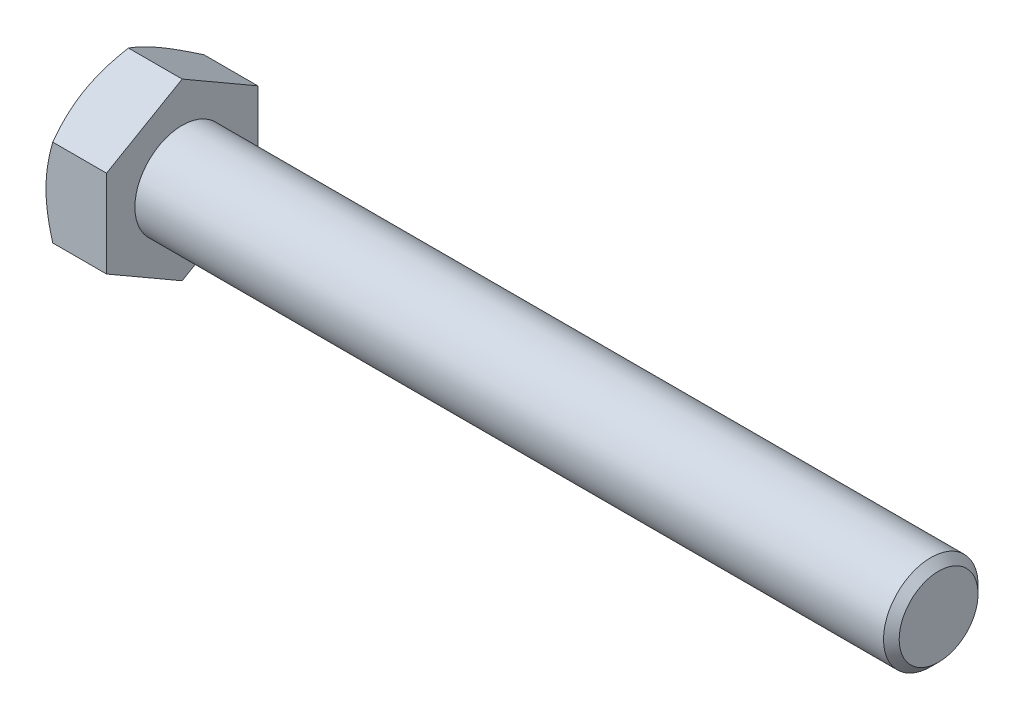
ISO-10303-21;
HEADER;
FILE_DESCRIPTION(('STEP AP214'),'2;1');
FILE_NAME('part.step','',(''),(''),'','','');
FILE_SCHEMA(('AUTOMOTIVE_DESIGN { 1 0 10303 214 1 1 1 1 }'));
ENDSEC;
DATA;
#1=APPLICATION_CONTEXT('core data for automotive mechanical design processes');
#2=APPLICATION_PROTOCOL_DEFINITION('international standard','automotive_design',2000,#1);
#3=PRODUCT_CONTEXT('',#1,'mechanical');
#4=PRODUCT('Part','Part','',(#3));
#5=PRODUCT_RELATED_PRODUCT_CATEGORY('part','',(#4));
#6=PRODUCT_DEFINITION_FORMATION('','',#4);
#7=PRODUCT_DEFINITION_CONTEXT('part definition',#1,'design');
#8=PRODUCT_DEFINITION('design','',#6,#7);
#9=PRODUCT_DEFINITION_SHAPE('','',#8);
#10=(LENGTH_UNIT() NAMED_UNIT(*) SI_UNIT(.MILLI.,.METRE.));
#11=(NAMED_UNIT(*) PLANE_ANGLE_UNIT() SI_UNIT($,.RADIAN.));
#12=(NAMED_UNIT(*) SI_UNIT($,.STERADIAN.) SOLID_ANGLE_UNIT());
#13=UNCERTAINTY_MEASURE_WITH_UNIT(LENGTH_MEASURE(1.E-05),#10,'distance_accuracy_value','');
#14=(GEOMETRIC_REPRESENTATION_CONTEXT(3) GLOBAL_UNCERTAINTY_ASSIGNED_CONTEXT((#13)) GLOBAL_UNIT_ASSIGNED_CONTEXT((#10,
#11,#12)) REPRESENTATION_CONTEXT('',''));
#15=CARTESIAN_POINT('',(0.,0.,0.));
#16=DIRECTION('',(0.,0.,1.));
#17=DIRECTION('',(1.,0.,0.));
#18=AXIS2_PLACEMENT_3D('',#15,#16,#17);
#19=CARTESIAN_POINT('',(6.4,9.23760430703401,0.));
#20=DIRECTION('',(1.,0.,0.));
#21=DIRECTION('',(0.,0.,-1.));
#22=AXIS2_PLACEMENT_3D('',#19,#20,#21);
#23=PLANE('',#22);
#24=DIRECTION('',(0.,0.5,0.866025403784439));
#25=VECTOR('',#24,1.);
#26=CARTESIAN_POINT('',(6.4,4.618802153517,-7.99999999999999));
#27=LINE('',#26,#25);
#28=CARTESIAN_POINT('',(6.4,4.618802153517,-7.99999999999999));
#29=VERTEX_POINT('',#28);
#30=CARTESIAN_POINT('',(6.4,9.23760430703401,0.));
#31=VERTEX_POINT('',#30);
#32=EDGE_CURVE('E160',#29,#31,#27,.T.);
#33=ORIENTED_EDGE('',*,*,#32,.T.);
#34=DIRECTION('',(0.,-0.5,0.866025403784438));
#35=VECTOR('',#34,1.);
#36=CARTESIAN_POINT('',(6.4,9.23760430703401,0.));
#37=LINE('',#36,#35);
#38=CARTESIAN_POINT('',(6.4,4.618802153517,8.00000000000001));
#39=VERTEX_POINT('',#38);
#40=EDGE_CURVE('E151',#31,#39,#37,.T.);
#41=ORIENTED_EDGE('',*,*,#40,.T.);
#42=DIRECTION('',(0.,-1.,0.));
#43=VECTOR('',#42,1.);
#44=CARTESIAN_POINT('',(6.4,4.618802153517,8.00000000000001));
#45=LINE('',#44,#43);
#46=CARTESIAN_POINT('',(6.4,-4.61880215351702,8.00000000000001));
#47=VERTEX_POINT('',#46);
#48=EDGE_CURVE('E134',#39,#47,#45,.T.);
#49=ORIENTED_EDGE('',*,*,#48,.T.);
#50=DIRECTION('',(0.,-0.500000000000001,-0.866025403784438));
#51=VECTOR('',#50,1.);
#52=CARTESIAN_POINT('',(6.4,-4.61880215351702,8.00000000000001));
#53=LINE('',#52,#51);
#54=CARTESIAN_POINT('',(6.4,-9.23760430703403,0.));
#55=VERTEX_POINT('',#54);
#56=EDGE_CURVE('E154',#47,#55,#53,.T.);
#57=ORIENTED_EDGE('',*,*,#56,.T.);
#58=DIRECTION('',(0.,0.5,-0.866025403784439));
#59=VECTOR('',#58,1.);
#60=CARTESIAN_POINT('',(6.4,-9.23760430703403,0.));
#61=LINE('',#60,#59);
#62=CARTESIAN_POINT('',(6.4,-4.61880215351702,-7.99999999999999));
#63=VERTEX_POINT('',#62);
#64=EDGE_CURVE('E146',#55,#63,#61,.T.);
#65=ORIENTED_EDGE('',*,*,#64,.T.);
#66=DIRECTION('',(0.,1.,0.));
#67=VECTOR('',#66,1.);
#68=CARTESIAN_POINT('',(6.4,-4.61880215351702,-7.99999999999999));
#69=LINE('',#68,#67);
#70=EDGE_CURVE('E147',#63,#29,#69,.T.);
#71=ORIENTED_EDGE('',*,*,#70,.T.);
#72=EDGE_LOOP('',(#33,#41,#49,#57,#65,#71));
#73=FACE_BOUND('',#72,.T.);
#74=CARTESIAN_POINT('',(6.4,0.,0.));
#75=DIRECTION('',(1.,0.,0.));
#76=DIRECTION('',(0.,0.,-1.));
#77=AXIS2_PLACEMENT_3D('',#74,#75,#76);
#78=CIRCLE('',#77,5.00000000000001);
#79=CARTESIAN_POINT('',(6.4,0.,-5.00000000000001));
#80=VERTEX_POINT('',#79);
#81=EDGE_CURVE('E249',#80,#80,#78,.F.);
#82=ORIENTED_EDGE('',*,*,#81,.T.);
#83=EDGE_LOOP('',(#82));
#84=FACE_BOUND('',#83,.T.);
#85=ADVANCED_FACE('F39',(#73,#84),#23,.T.);
#86=CARTESIAN_POINT('',(6.4,4.618802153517,-7.99999999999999));
#87=DIRECTION('',(0.,-0.866025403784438,0.5));
#88=DIRECTION('',(0.,-0.5,-0.866025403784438));
#89=AXIS2_PLACEMENT_3D('',#86,#87,#88);
#90=PLANE('',#89);
#91=CARTESIAN_POINT('',(0.71459784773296,9.23771977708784,0.000200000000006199));
#92=CARTESIAN_POINT('',(0.655990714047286,9.13619343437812,-0.17564878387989));
#93=CARTESIAN_POINT('',(0.600043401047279,9.03428856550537,-0.352153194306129));
#94=CARTESIAN_POINT('',(0.494201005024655,8.82965122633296,-0.706595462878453));
#95=CARTESIAN_POINT('',(0.444308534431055,8.72691841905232,-0.884533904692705));
#96=CARTESIAN_POINT('',(0.304692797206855,8.41707512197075,-1.42119823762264));
#97=CARTESIAN_POINT('',(0.225281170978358,8.20874154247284,-1.78204258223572));
#98=CARTESIAN_POINT('',(0.132161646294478,7.89697436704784,-2.32203917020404));
#99=CARTESIAN_POINT('',(0.105634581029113,7.79447216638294,-2.49957818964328));
#100=CARTESIAN_POINT('',(0.0611531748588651,7.58900421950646,-2.85545911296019));
#101=CARTESIAN_POINT('',(0.0431980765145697,7.48603851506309,-3.03380094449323));
#102=CARTESIAN_POINT('',(0.0163156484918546,7.27992981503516,-3.39079168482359));
#103=CARTESIAN_POINT('',(0.00737807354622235,7.17678715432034,-3.56944001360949));
#104=CARTESIAN_POINT('',(-0.00127769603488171,6.97040655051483,-3.92690170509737));
#105=CARTESIAN_POINT('',(-0.000996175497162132,6.86716861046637,-4.10571506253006));
#106=CARTESIAN_POINT('',(0.00814502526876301,6.67416139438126,-4.4400133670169));
#107=CARTESIAN_POINT('',(0.0158896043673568,6.58437849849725,-4.59552190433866));
#108=CARTESIAN_POINT('',(0.0382011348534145,6.40502298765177,-4.9061747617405));
#109=CARTESIAN_POINT('',(0.0527685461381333,6.31545038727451,-5.06131905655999));
#110=CARTESIAN_POINT('',(0.106360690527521,6.04707935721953,-5.52615131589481));
#111=CARTESIAN_POINT('',(0.155268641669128,5.86875596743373,-5.83501648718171));
#112=CARTESIAN_POINT('',(0.277539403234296,5.51021755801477,-6.45602322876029));
#113=CARTESIAN_POINT('',(0.35142052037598,5.3300482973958,-6.76808554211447));
#114=CARTESIAN_POINT('',(0.519100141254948,4.97239658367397,-7.38755648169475));
#115=CARTESIAN_POINT('',(0.61285926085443,4.79490955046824,-7.69497304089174));
#116=CARTESIAN_POINT('',(0.71459784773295,4.61868668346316,-8.00019999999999));
#117=B_SPLINE_CURVE_WITH_KNOTS('',3,(#91,#92,#93,#94,#95,#96,#97,#98,#99,#100,#101,#102,#103,
#104,#105,#106,#107,#108,#109,#110,#111,#112,#113,#114,#115,#116),.UNSPECIFIED.,.F.,.F.,(4,2,2,
2,2,2,2,2,2,2,2,2,4),(0.,0.633973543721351,1.26821965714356,2.53934712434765,3.15934343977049,
3.77928496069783,4.39852133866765,5.01773858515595,5.55680239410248,6.09590254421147,
7.17487077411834,8.27776850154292,9.37850115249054),.UNSPECIFIED.);
#118=CARTESIAN_POINT('',(0.714531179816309,9.23760430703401,0.));
#119=VERTEX_POINT('',#118);
#120=CARTESIAN_POINT('',(0.,6.92820323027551,-4.00000000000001));
#121=VERTEX_POINT('',#120);
#122=EDGE_CURVE('E57',#119,#121,#117,.T.);
#123=ORIENTED_EDGE('',*,*,#122,.F.);
#124=DIRECTION('',(-1.,0.,0.));
#125=VECTOR('',#124,1.);
#126=CARTESIAN_POINT('',(6.4,9.23760430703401,0.));
#127=LINE('',#126,#125);
#128=EDGE_CURVE('E132',#31,#119,#127,.T.);
#129=ORIENTED_EDGE('',*,*,#128,.F.);
#130=ORIENTED_EDGE('',*,*,#32,.F.);
#131=DIRECTION('',(-1.,0.,0.));
#132=VECTOR('',#131,1.);
#133=CARTESIAN_POINT('',(6.4,4.618802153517,-7.99999999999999));
#134=LINE('',#133,#132);
#135=CARTESIAN_POINT('',(0.714531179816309,4.61880215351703,-7.99999999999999));
#136=VERTEX_POINT('',#135);
#137=EDGE_CURVE('E143',#29,#136,#134,.T.);
#138=ORIENTED_EDGE('',*,*,#137,.T.);
#139=EDGE_CURVE('E202',#121,#136,#117,.T.);
#140=ORIENTED_EDGE('',*,*,#139,.F.);
#141=EDGE_LOOP('',(#123,#129,#130,#138,#140));
#142=FACE_BOUND('',#141,.T.);
#143=ADVANCED_FACE('F41',(#142),#90,.F.);
#144=CARTESIAN_POINT('',(6.4,9.23760430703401,0.));
#145=DIRECTION('',(0.,-0.866025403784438,-0.5));
#146=DIRECTION('',(0.,0.5,-0.866025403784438));
#147=AXIS2_PLACEMENT_3D('',#144,#145,#146);
#148=PLANE('',#147);
#149=CARTESIAN_POINT('',(0.71459784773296,4.61868668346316,8.00020000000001));
#150=CARTESIAN_POINT('',(0.655990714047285,4.72021302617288,7.82435121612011));
#151=CARTESIAN_POINT('',(0.600043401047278,4.82211789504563,7.64784680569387));
#152=CARTESIAN_POINT('',(0.494201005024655,5.02675523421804,7.29340453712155));
#153=CARTESIAN_POINT('',(0.444308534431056,5.12948804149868,7.1154660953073));
#154=CARTESIAN_POINT('',(0.304692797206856,5.43933133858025,6.57880176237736));
#155=CARTESIAN_POINT('',(0.22528117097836,5.64766491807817,6.21795741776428));
#156=CARTESIAN_POINT('',(0.132161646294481,5.95943209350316,5.67796082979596));
#157=CARTESIAN_POINT('',(0.105634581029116,6.06193429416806,5.50042181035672));
#158=CARTESIAN_POINT('',(0.0611531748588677,6.26740224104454,5.14454088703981));
#159=CARTESIAN_POINT('',(0.0431980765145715,6.37036794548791,4.96619905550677));
#160=CARTESIAN_POINT('',(0.0163156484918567,6.57647664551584,4.60920831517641));
#161=CARTESIAN_POINT('',(0.00737807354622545,6.67961930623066,4.43055998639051));
#162=CARTESIAN_POINT('',(-0.00127769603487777,6.88599991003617,4.07309829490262));
#163=CARTESIAN_POINT('',(-0.000996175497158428,6.98923785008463,3.89428493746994));
#164=CARTESIAN_POINT('',(0.00814502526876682,7.18224506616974,3.5599866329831));
#165=CARTESIAN_POINT('',(0.0158896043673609,7.27202796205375,3.40447809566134));
#166=CARTESIAN_POINT('',(0.0382011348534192,7.45138347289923,3.0938252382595));
#167=CARTESIAN_POINT('',(0.0527685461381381,7.54095607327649,2.93868094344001));
#168=CARTESIAN_POINT('',(0.106360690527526,7.80932710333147,2.47384868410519));
#169=CARTESIAN_POINT('',(0.155268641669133,7.98765049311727,2.16498351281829));
#170=CARTESIAN_POINT('',(0.277539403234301,8.34618890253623,1.54397677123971));
#171=CARTESIAN_POINT('',(0.351420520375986,8.52635816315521,1.23191445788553));
#172=CARTESIAN_POINT('',(0.519100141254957,8.88400987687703,0.612443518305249));
#173=CARTESIAN_POINT('',(0.61285926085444,9.06149691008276,0.305026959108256));
#174=CARTESIAN_POINT('',(0.714597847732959,9.23771977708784,-0.000199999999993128));
#175=B_SPLINE_CURVE_WITH_KNOTS('',3,(#149,#150,#151,#152,#153,#154,#155,#156,#157,#158,#159,
#160,#161,#162,#163,#164,#165,#166,#167,#168,#169,#170,#171,#172,#173,#174),.UNSPECIFIED.,.F.,
.F.,(4,2,2,2,2,2,2,2,2,2,2,2,4),(0.,0.63397354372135,1.26821965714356,2.53934712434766,
3.15934343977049,3.77928496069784,4.39852133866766,5.01773858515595,5.55680239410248,
6.09590254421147,7.17487077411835,8.27776850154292,9.37850115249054),.UNSPECIFIED.);
#176=CARTESIAN_POINT('',(0.714531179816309,4.61880215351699,8.00000000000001));
#177=VERTEX_POINT('',#176);
#178=CARTESIAN_POINT('',(0.,6.92820323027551,4.00000000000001));
#179=VERTEX_POINT('',#178);
#180=EDGE_CURVE('E62',#177,#179,#175,.T.);
#181=ORIENTED_EDGE('',*,*,#180,.F.);
#182=DIRECTION('',(-1.,0.,0.));
#183=VECTOR('',#182,1.);
#184=CARTESIAN_POINT('',(6.4,4.618802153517,8.00000000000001));
#185=LINE('',#184,#183);
#186=EDGE_CURVE('E123',#39,#177,#185,.T.);
#187=ORIENTED_EDGE('',*,*,#186,.F.);
#188=ORIENTED_EDGE('',*,*,#40,.F.);
#189=ORIENTED_EDGE('',*,*,#128,.T.);
#190=EDGE_CURVE('E127',#179,#119,#175,.T.);
#191=ORIENTED_EDGE('',*,*,#190,.F.);
#192=EDGE_LOOP('',(#181,#187,#188,#189,#191));
#193=FACE_BOUND('',#192,.T.);
#194=ADVANCED_FACE('F121',(#193),#148,.F.);
#195=CARTESIAN_POINT('',(6.4,4.618802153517,8.00000000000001));
#196=DIRECTION('',(0.,0.,-1.));
#197=DIRECTION('',(-1.,0.,0.));
#198=AXIS2_PLACEMENT_3D('',#195,#196,#197);
#199=PLANE('',#198);
#200=CARTESIAN_POINT('',(3.82821364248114,-12.2497439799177,8.00000000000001));
#201=CARTESIAN_POINT('',(3.65847254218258,-11.8984987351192,8.00000000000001));
#202=CARTESIAN_POINT('',(3.49041880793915,-11.5464230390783,8.00000000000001));
#203=CARTESIAN_POINT('',(3.15865029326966,-10.8401616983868,8.00000000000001));
#204=CARTESIAN_POINT('',(2.9949362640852,-10.4859757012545,8.00000000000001));
#205=CARTESIAN_POINT('',(2.67194892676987,-9.77313142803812,8.00000000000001));
#206=CARTESIAN_POINT('',(2.51270639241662,-9.41445915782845,8.00000000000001));
#207=CARTESIAN_POINT('',(2.20106116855,-8.69416671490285,8.00000000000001));
#208=CARTESIAN_POINT('',(2.04865812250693,-8.33254669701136,8.00000000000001));
#209=CARTESIAN_POINT('',(1.75070130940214,-7.60129405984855,8.00000000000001));
#210=CARTESIAN_POINT('',(1.60525460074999,-7.23161757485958,8.00000000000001));
#211=CARTESIAN_POINT('',(1.3257524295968,-6.48790521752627,8.00000000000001));
#212=CARTESIAN_POINT('',(1.1916982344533,-6.11386886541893,8.00000000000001));
#213=CARTESIAN_POINT('',(0.93858361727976,-5.36160531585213,8.00000000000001));
#214=CARTESIAN_POINT('',(0.81949131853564,-4.98338896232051,8.00000000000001));
#215=CARTESIAN_POINT('',(0.600166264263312,-4.22159300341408,8.00000000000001));
#216=CARTESIAN_POINT('',(0.499927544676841,-3.83801513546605,8.00000000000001));
#217=CARTESIAN_POINT('',(0.323183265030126,-3.06517005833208,8.00000000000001));
#218=CARTESIAN_POINT('',(0.246684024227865,-2.67590136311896,8.00000000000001));
#219=CARTESIAN_POINT('',(0.153570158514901,-2.08857290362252,8.00000000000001));
#220=CARTESIAN_POINT('',(0.126136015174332,-1.89220175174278,8.00000000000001));
#221=CARTESIAN_POINT('',(0.0790191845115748,-1.49853877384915,8.00000000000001));
#222=CARTESIAN_POINT('',(0.0593357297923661,-1.3012470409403,8.00000000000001));
#223=CARTESIAN_POINT('',(0.0282499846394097,-0.907261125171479,8.00000000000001));
#224=CARTESIAN_POINT('',(0.0167962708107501,-0.71057101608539,8.00000000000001));
#225=CARTESIAN_POINT('',(0.0022305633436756,-0.316882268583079,8.00000000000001));
#226=CARTESIAN_POINT('',(-0.00088153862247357,-0.119883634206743,8.00000000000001));
#227=CARTESIAN_POINT('',(0.00131013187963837,0.274012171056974,8.00000000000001));
#228=CARTESIAN_POINT('',(0.00661154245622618,0.47090935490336,8.00000000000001));
#229=CARTESIAN_POINT('',(0.0254984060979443,0.864308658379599,8.00000000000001));
#230=CARTESIAN_POINT('',(0.0390842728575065,1.06081075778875,8.00000000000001));
#231=CARTESIAN_POINT('',(0.0817685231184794,1.53707134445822,8.00000000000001));
#232=CARTESIAN_POINT('',(0.11501771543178,1.81646391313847,8.00000000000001));
#233=CARTESIAN_POINT('',(0.196418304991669,2.37310809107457,8.00000000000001));
#234=CARTESIAN_POINT('',(0.244573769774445,2.65035909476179,8.00000000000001));
#235=CARTESIAN_POINT('',(0.354078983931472,3.20249141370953,8.00000000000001));
#236=CARTESIAN_POINT('',(0.415441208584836,3.47737023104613,8.00000000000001));
#237=CARTESIAN_POINT('',(0.549487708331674,4.02429975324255,8.00000000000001));
#238=CARTESIAN_POINT('',(0.622170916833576,4.29635072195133,8.00000000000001));
#239=CARTESIAN_POINT('',(0.779020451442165,4.84432510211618,8.00000000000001));
#240=CARTESIAN_POINT('',(0.863424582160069,5.12017997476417,8.00000000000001));
#241=CARTESIAN_POINT('',(1.04057245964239,5.66897392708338,8.00000000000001));
#242=CARTESIAN_POINT('',(1.13331045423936,5.94191487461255,8.00000000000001));
#243=CARTESIAN_POINT('',(1.32521046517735,6.48378576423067,8.00000000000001));
#244=CARTESIAN_POINT('',(1.42433338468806,6.75272963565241,8.00000000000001));
#245=CARTESIAN_POINT('',(1.62839717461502,7.28853074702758,8.00000000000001));
#246=CARTESIAN_POINT('',(1.73334039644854,7.5553870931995,8.00000000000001));
#247=CARTESIAN_POINT('',(1.84061801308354,7.82127397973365,8.00000000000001));
#248=B_SPLINE_CURVE_WITH_KNOTS('',3,(#200,#201,#202,#203,#204,#205,#206,#207,#208,#209,#210,
#211,#212,#213,#214,#215,#216,#217,#218,#219,#220,#221,#222,#223,#224,#225,#226,#227,#228,#229,
#230,#231,#232,#233,#234,#235,#236,#237,#238,#239,#240,#241,#242,#243,#244,#245,#246,#247),
.UNSPECIFIED.,.F.,.F.,(4,2,2,2,2,2,2,2,2,2,2,2,2,2,2,2,2,2,2,2,2,2,2,4),(0.,1.17034358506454,
2.3408884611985,3.51813189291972,4.69531388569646,5.88694801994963,7.07871454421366,
8.26789729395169,9.45670322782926,10.6458253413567,11.2405311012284,11.8351779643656,
12.4260760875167,13.0169665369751,13.6076911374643,14.1984452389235,15.0420672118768,
15.8859195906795,16.7305726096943,17.5751460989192,18.4404219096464,19.305105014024,
20.1649211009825,21.0250871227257),.UNSPECIFIED.);
#249=CARTESIAN_POINT('',(0.714531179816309,-4.61880215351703,8.00000000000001));
#250=VERTEX_POINT('',#249);
#251=CARTESIAN_POINT('',(0.,0.,8.00000000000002));
#252=VERTEX_POINT('',#251);
#253=EDGE_CURVE('E117',#250,#252,#248,.T.);
#254=ORIENTED_EDGE('',*,*,#253,.F.);
#255=DIRECTION('',(-1.,0.,0.));
#256=VECTOR('',#255,1.);
#257=CARTESIAN_POINT('',(6.4,-4.61880215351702,8.00000000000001));
#258=LINE('',#257,#256);
#259=EDGE_CURVE('E135',#47,#250,#258,.T.);
#260=ORIENTED_EDGE('',*,*,#259,.F.);
#261=ORIENTED_EDGE('',*,*,#48,.F.);
#262=ORIENTED_EDGE('',*,*,#186,.T.);
#263=EDGE_CURVE('E109',#252,#177,#248,.T.);
#264=ORIENTED_EDGE('',*,*,#263,.F.);
#265=EDGE_LOOP('',(#254,#260,#261,#262,#264));
#266=FACE_BOUND('',#265,.T.);
#267=ADVANCED_FACE('F126',(#266),#199,.F.);
#268=CARTESIAN_POINT('',(6.4,-4.61880215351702,8.00000000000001));
#269=DIRECTION('',(0.,0.866025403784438,-0.500000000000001));
#270=DIRECTION('',(0.,0.500000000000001,0.866025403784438));
#271=AXIS2_PLACEMENT_3D('',#268,#269,#270);
#272=PLANE('',#271);
#273=CARTESIAN_POINT('',(0.71459784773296,-9.23771977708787,-0.000199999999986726));
#274=CARTESIAN_POINT('',(0.655990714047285,-9.13619343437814,0.175648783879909));
#275=CARTESIAN_POINT('',(0.600043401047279,-9.0342885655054,0.352153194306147));
#276=CARTESIAN_POINT('',(0.494201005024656,-8.82965122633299,0.706595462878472));
#277=CARTESIAN_POINT('',(0.444308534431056,-8.72691841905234,0.884533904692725));
#278=CARTESIAN_POINT('',(0.304692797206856,-8.41707512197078,1.42119823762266));
#279=CARTESIAN_POINT('',(0.225281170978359,-8.20874154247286,1.78204258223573));
#280=CARTESIAN_POINT('',(0.13216164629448,-7.89697436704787,2.32203917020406));
#281=CARTESIAN_POINT('',(0.105634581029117,-7.79447216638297,2.4995781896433));
#282=CARTESIAN_POINT('',(0.0611531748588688,-7.58900421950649,2.85545911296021));
#283=CARTESIAN_POINT('',(0.043198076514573,-7.48603851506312,3.03380094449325));
#284=CARTESIAN_POINT('',(0.0163156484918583,-7.27992981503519,3.39079168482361));
#285=CARTESIAN_POINT('',(0.00737807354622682,-7.17678715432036,3.56944001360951));
#286=CARTESIAN_POINT('',(-0.00127769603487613,-6.97040655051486,3.9269017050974));
#287=CARTESIAN_POINT('',(-0.000996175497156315,-6.8671686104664,4.10571506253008));
#288=CARTESIAN_POINT('',(0.00814502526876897,-6.67416139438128,4.44001336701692));
#289=CARTESIAN_POINT('',(0.0158896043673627,-6.58437849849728,4.59552190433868));
#290=CARTESIAN_POINT('',(0.0382011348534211,-6.4050229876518,4.90617476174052));
#291=CARTESIAN_POINT('',(0.0527685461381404,-6.31545038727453,5.06131905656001));
#292=CARTESIAN_POINT('',(0.106360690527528,-6.04707935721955,5.52615131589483));
#293=CARTESIAN_POINT('',(0.155268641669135,-5.86875596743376,5.83501648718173));
#294=CARTESIAN_POINT('',(0.277539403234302,-5.51021755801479,6.45602322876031));
#295=CARTESIAN_POINT('',(0.351420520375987,-5.33004829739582,6.76808554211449));
#296=CARTESIAN_POINT('',(0.519100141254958,-4.972396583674,7.38755648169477));
#297=CARTESIAN_POINT('',(0.61285926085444,-4.79490955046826,7.69497304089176));
#298=CARTESIAN_POINT('',(0.71459784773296,-4.61868668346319,8.00020000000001));
#299=B_SPLINE_CURVE_WITH_KNOTS('',3,(#273,#274,#275,#276,#277,#278,#279,#280,#281,#282,#283,
#284,#285,#286,#287,#288,#289,#290,#291,#292,#293,#294,#295,#296,#297,#298),.UNSPECIFIED.,.F.,
.F.,(4,2,2,2,2,2,2,2,2,2,2,2,4),(0.,0.63397354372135,1.26821965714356,2.53934712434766,
3.15934343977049,3.77928496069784,4.39852133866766,5.01773858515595,5.55680239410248,
6.09590254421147,7.17487077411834,8.27776850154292,9.37850115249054),.UNSPECIFIED.);
#300=CARTESIAN_POINT('',(0.714531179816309,-9.23760430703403,0.));
#301=VERTEX_POINT('',#300);
#302=CARTESIAN_POINT('',(0.,-6.92820323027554,4.00000000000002));
#303=VERTEX_POINT('',#302);
#304=EDGE_CURVE('E209',#301,#303,#299,.T.);
#305=ORIENTED_EDGE('',*,*,#304,.F.);
#306=DIRECTION('',(-1.,0.,0.));
#307=VECTOR('',#306,1.);
#308=CARTESIAN_POINT('',(6.4,-9.23760430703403,0.));
#309=LINE('',#308,#307);
#310=EDGE_CURVE('E140',#55,#301,#309,.T.);
#311=ORIENTED_EDGE('',*,*,#310,.F.);
#312=ORIENTED_EDGE('',*,*,#56,.F.);
#313=ORIENTED_EDGE('',*,*,#259,.T.);
#314=EDGE_CURVE('E118',#303,#250,#299,.T.);
#315=ORIENTED_EDGE('',*,*,#314,.F.);
#316=EDGE_LOOP('',(#305,#311,#312,#313,#315));
#317=FACE_BOUND('',#316,.T.);
#318=ADVANCED_FACE('F211',(#317),#272,.F.);
#319=CARTESIAN_POINT('',(6.4,-9.23760430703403,0.));
#320=DIRECTION('',(0.,0.866025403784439,0.5));
#321=DIRECTION('',(0.,-0.5,0.866025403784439));
#322=AXIS2_PLACEMENT_3D('',#319,#320,#321);
#323=PLANE('',#322);
#324=CARTESIAN_POINT('',(0.714597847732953,-4.61868668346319,-8.00019999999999));
#325=CARTESIAN_POINT('',(0.655990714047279,-4.72021302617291,-7.8243512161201));
#326=CARTESIAN_POINT('',(0.600043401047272,-4.82211789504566,-7.64784680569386));
#327=CARTESIAN_POINT('',(0.494201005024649,-5.02675523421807,-7.29340453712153));
#328=CARTESIAN_POINT('',(0.44430853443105,-5.12948804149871,-7.11546609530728));
#329=CARTESIAN_POINT('',(0.30469279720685,-5.43933133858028,-6.57880176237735));
#330=CARTESIAN_POINT('',(0.225281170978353,-5.64766491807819,-6.21795741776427));
#331=CARTESIAN_POINT('',(0.132161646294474,-5.95943209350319,-5.67796082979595));
#332=CARTESIAN_POINT('',(0.10563458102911,-6.06193429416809,-5.50042181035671));
#333=CARTESIAN_POINT('',(0.0611531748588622,-6.26740224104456,-5.1445408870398));
#334=CARTESIAN_POINT('',(0.0431980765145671,-6.37036794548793,-4.96619905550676));
#335=CARTESIAN_POINT('',(0.0163156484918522,-6.57647664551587,-4.6092083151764));
#336=CARTESIAN_POINT('',(0.00737807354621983,-6.67961930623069,-4.4305599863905));
#337=CARTESIAN_POINT('',(-0.00127769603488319,-6.8859999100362,-4.07309829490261));
#338=CARTESIAN_POINT('',(-0.000996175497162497,-6.98923785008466,-3.89428493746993));
#339=CARTESIAN_POINT('',(0.00814502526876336,-7.18224506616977,-3.55998663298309));
#340=CARTESIAN_POINT('',(0.015889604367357,-7.27202796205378,-3.40447809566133));
#341=CARTESIAN_POINT('',(0.0382011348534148,-7.45138347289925,-3.09382523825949));
#342=CARTESIAN_POINT('',(0.0527685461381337,-7.54095607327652,-2.93868094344));
#343=CARTESIAN_POINT('',(0.106360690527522,-7.8093271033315,-2.47384868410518));
#344=CARTESIAN_POINT('',(0.155268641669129,-7.98765049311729,-2.16498351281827));
#345=CARTESIAN_POINT('',(0.277539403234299,-8.34618890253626,-1.54397677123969));
#346=CARTESIAN_POINT('',(0.351420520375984,-8.52635816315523,-1.23191445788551));
#347=CARTESIAN_POINT('',(0.519100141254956,-8.88400987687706,-0.61244351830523));
#348=CARTESIAN_POINT('',(0.612859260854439,-9.06149691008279,-0.305026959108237));
#349=CARTESIAN_POINT('',(0.714597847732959,-9.23771977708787,0.00020000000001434));
#350=B_SPLINE_CURVE_WITH_KNOTS('',3,(#324,#325,#326,#327,#328,#329,#330,#331,#332,#333,#334,
#335,#336,#337,#338,#339,#340,#341,#342,#343,#344,#345,#346,#347,#348,#349),.UNSPECIFIED.,.F.,
.F.,(4,2,2,2,2,2,2,2,2,2,2,2,4),(0.,0.63397354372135,1.26821965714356,2.53934712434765,
3.15934343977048,3.77928496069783,4.39852133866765,5.01773858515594,5.55680239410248,
6.09590254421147,7.17487077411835,8.27776850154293,9.37850115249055),.UNSPECIFIED.);
#351=CARTESIAN_POINT('',(0.714531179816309,-4.61880215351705,-7.99999999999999));
#352=VERTEX_POINT('',#351);
#353=CARTESIAN_POINT('',(0.,-6.92820323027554,-4.00000000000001));
#354=VERTEX_POINT('',#353);
#355=EDGE_CURVE('E198',#352,#354,#350,.T.);
#356=ORIENTED_EDGE('',*,*,#355,.F.);
#357=DIRECTION('',(-1.,0.,0.));
#358=VECTOR('',#357,1.);
#359=CARTESIAN_POINT('',(6.4,-4.61880215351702,-7.99999999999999));
#360=LINE('',#359,#358);
#361=EDGE_CURVE('E145',#63,#352,#360,.T.);
#362=ORIENTED_EDGE('',*,*,#361,.F.);
#363=ORIENTED_EDGE('',*,*,#64,.F.);
#364=ORIENTED_EDGE('',*,*,#310,.T.);
#365=EDGE_CURVE('E215',#354,#301,#350,.T.);
#366=ORIENTED_EDGE('',*,*,#365,.F.);
#367=EDGE_LOOP('',(#356,#362,#363,#364,#366));
#368=FACE_BOUND('',#367,.T.);
#369=ADVANCED_FACE('F217',(#368),#323,.F.);
#370=CARTESIAN_POINT('',(6.4,-4.61880215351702,-7.99999999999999));
#371=DIRECTION('',(0.,0.,1.));
#372=DIRECTION('',(0.,-1.,0.));
#373=AXIS2_PLACEMENT_3D('',#370,#371,#372);
#374=PLANE('',#373);
#375=CARTESIAN_POINT('',(3.82821364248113,-12.2497439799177,-8.));
#376=CARTESIAN_POINT('',(3.65847254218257,-11.8984987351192,-8.));
#377=CARTESIAN_POINT('',(3.49041880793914,-11.5464230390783,-8.));
#378=CARTESIAN_POINT('',(3.15865029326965,-10.8401616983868,-8.));
#379=CARTESIAN_POINT('',(2.99493626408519,-10.4859757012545,-8.));
#380=CARTESIAN_POINT('',(2.67194892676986,-9.77313142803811,-8.));
#381=CARTESIAN_POINT('',(2.51270639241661,-9.41445915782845,-8.));
#382=CARTESIAN_POINT('',(2.20106116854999,-8.69416671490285,-8.));
#383=CARTESIAN_POINT('',(2.04865812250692,-8.33254669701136,-7.99999999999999));
#384=CARTESIAN_POINT('',(1.75070130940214,-7.60129405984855,-7.99999999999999));
#385=CARTESIAN_POINT('',(1.60525460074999,-7.23161757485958,-7.99999999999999));
#386=CARTESIAN_POINT('',(1.32575242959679,-6.48790521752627,-7.99999999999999));
#387=CARTESIAN_POINT('',(1.19169823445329,-6.11386886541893,-7.99999999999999));
#388=CARTESIAN_POINT('',(0.938583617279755,-5.36160531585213,-7.99999999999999));
#389=CARTESIAN_POINT('',(0.819491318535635,-4.98338896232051,-7.99999999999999));
#390=CARTESIAN_POINT('',(0.600166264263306,-4.22159300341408,-7.99999999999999));
#391=CARTESIAN_POINT('',(0.499927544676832,-3.83801513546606,-7.99999999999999));
#392=CARTESIAN_POINT('',(0.323183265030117,-3.06517005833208,-7.99999999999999));
#393=CARTESIAN_POINT('',(0.246684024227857,-2.67590136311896,-7.99999999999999));
#394=CARTESIAN_POINT('',(0.153570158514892,-2.08857290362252,-7.99999999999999));
#395=CARTESIAN_POINT('',(0.126136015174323,-1.89220175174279,-7.99999999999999));
#396=CARTESIAN_POINT('',(0.0790191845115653,-1.49853877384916,-7.99999999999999));
#397=CARTESIAN_POINT('',(0.0593357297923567,-1.3012470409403,-7.99999999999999));
#398=CARTESIAN_POINT('',(0.0282499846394,-0.907261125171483,-7.99999999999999));
#399=CARTESIAN_POINT('',(0.0167962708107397,-0.710571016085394,-7.99999999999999));
#400=CARTESIAN_POINT('',(0.00223056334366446,-0.316882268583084,-7.99999999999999));
#401=CARTESIAN_POINT('',(-0.000881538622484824,-0.119883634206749,-7.99999999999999));
#402=CARTESIAN_POINT('',(0.00131013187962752,0.274012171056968,-7.99999999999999));
#403=CARTESIAN_POINT('',(0.00661154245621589,0.470909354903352,-7.99999999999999));
#404=CARTESIAN_POINT('',(0.025498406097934,0.864308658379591,-7.99999999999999));
#405=CARTESIAN_POINT('',(0.0390842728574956,1.06081075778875,-7.99999999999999));
#406=CARTESIAN_POINT('',(0.0817685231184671,1.53707134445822,-7.99999999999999));
#407=CARTESIAN_POINT('',(0.115017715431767,1.81646391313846,-7.99999999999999));
#408=CARTESIAN_POINT('',(0.196418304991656,2.37310809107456,-7.99999999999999));
#409=CARTESIAN_POINT('',(0.244573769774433,2.65035909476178,-7.99999999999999));
#410=CARTESIAN_POINT('',(0.35407898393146,3.20249141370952,-7.99999999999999));
#411=CARTESIAN_POINT('',(0.415441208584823,3.47737023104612,-7.99999999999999));
#412=CARTESIAN_POINT('',(0.54948770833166,4.02429975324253,-7.99999999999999));
#413=CARTESIAN_POINT('',(0.622170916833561,4.29635072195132,-7.99999999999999));
#414=CARTESIAN_POINT('',(0.779020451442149,4.84432510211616,-7.99999999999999));
#415=CARTESIAN_POINT('',(0.863424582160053,5.12017997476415,-7.99999999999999));
#416=CARTESIAN_POINT('',(1.04057245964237,5.66897392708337,-7.99999999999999));
#417=CARTESIAN_POINT('',(1.13331045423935,5.94191487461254,-7.99999999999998));
#418=CARTESIAN_POINT('',(1.32521046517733,6.48378576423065,-7.99999999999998));
#419=CARTESIAN_POINT('',(1.42433338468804,6.75272963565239,-7.99999999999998));
#420=CARTESIAN_POINT('',(1.628397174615,7.28853074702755,-7.99999999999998));
#421=CARTESIAN_POINT('',(1.73334039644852,7.55538709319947,-7.99999999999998));
#422=CARTESIAN_POINT('',(1.84061801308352,7.82127397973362,-7.99999999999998));
#423=B_SPLINE_CURVE_WITH_KNOTS('',3,(#375,#376,#377,#378,#379,#380,#381,#382,#383,#384,#385,
#386,#387,#388,#389,#390,#391,#392,#393,#394,#395,#396,#397,#398,#399,#400,#401,#402,#403,#404,
#405,#406,#407,#408,#409,#410,#411,#412,#413,#414,#415,#416,#417,#418,#419,#420,#421,#422),
.UNSPECIFIED.,.F.,.F.,(4,2,2,2,2,2,2,2,2,2,2,2,2,2,2,2,2,2,2,2,2,2,2,4),(0.,1.17034358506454,
2.34088846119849,3.51813189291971,4.69531388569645,5.88694801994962,7.07871454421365,
8.26789729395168,9.45670322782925,10.6458253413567,11.2405311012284,11.8351779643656,
12.4260760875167,13.0169665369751,13.6076911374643,14.1984452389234,15.0420672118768,
15.8859195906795,16.7305726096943,17.5751460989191,18.4404219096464,19.305105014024,
20.1649211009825,21.0250871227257),.UNSPECIFIED.);
#424=CARTESIAN_POINT('',(0.,0.,-7.99999999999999));
#425=VERTEX_POINT('',#424);
#426=EDGE_CURVE('E377',#136,#425,#423,.F.);
#427=ORIENTED_EDGE('',*,*,#426,.F.);
#428=ORIENTED_EDGE('',*,*,#137,.F.);
#429=ORIENTED_EDGE('',*,*,#70,.F.);
#430=ORIENTED_EDGE('',*,*,#361,.T.);
#431=EDGE_CURVE('E187',#425,#352,#423,.F.);
#432=ORIENTED_EDGE('',*,*,#431,.F.);
#433=EDGE_LOOP('',(#427,#428,#429,#430,#432));
#434=FACE_BOUND('',#433,.T.);
#435=ADVANCED_FACE('F225',(#434),#374,.F.);
#436=CARTESIAN_POINT('',(0.,0.,0.));
#437=DIRECTION('',(1.,0.,0.));
#438=DIRECTION('',(0.,0.,-1.));
#439=AXIS2_PLACEMENT_3D('',#436,#437,#438);
#440=CONICAL_SURFACE('',#439,8.00000000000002,1.0471975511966);
#441=ORIENTED_EDGE('',*,*,#355,.T.);
#442=CARTESIAN_POINT('',(0.,0.,0.));
#443=DIRECTION('',(1.,0.,0.));
#444=DIRECTION('',(0.,0.,-1.));
#445=AXIS2_PLACEMENT_3D('',#442,#443,#444);
#446=CIRCLE('',#445,8.00000000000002);
#447=EDGE_CURVE('E42',#354,#425,#446,.T.);
#448=ORIENTED_EDGE('',*,*,#447,.T.);
#449=ORIENTED_EDGE('',*,*,#431,.T.);
#450=EDGE_LOOP('',(#441,#448,#449));
#451=FACE_BOUND('',#450,.T.);
#452=ADVANCED_FACE('F177',(#451),#440,.T.);
#453=ORIENTED_EDGE('',*,*,#304,.T.);
#454=EDGE_CURVE('E379',#303,#354,#446,.T.);
#455=ORIENTED_EDGE('',*,*,#454,.T.);
#456=ORIENTED_EDGE('',*,*,#365,.T.);
#457=EDGE_LOOP('',(#453,#455,#456));
#458=FACE_BOUND('',#457,.T.);
#459=ADVANCED_FACE('F180',(#458),#440,.T.);
#460=ORIENTED_EDGE('',*,*,#253,.T.);
#461=EDGE_CURVE('E394',#252,#303,#446,.T.);
#462=ORIENTED_EDGE('',*,*,#461,.T.);
#463=ORIENTED_EDGE('',*,*,#314,.T.);
#464=EDGE_LOOP('',(#460,#462,#463));
#465=FACE_BOUND('',#464,.T.);
#466=ADVANCED_FACE('F175',(#465),#440,.T.);
#467=ORIENTED_EDGE('',*,*,#263,.T.);
#468=ORIENTED_EDGE('',*,*,#180,.T.);
#469=CARTESIAN_POINT('',(0.,0.,0.));
#470=DIRECTION('',(-1.,0.,0.));
#471=DIRECTION('',(0.,0.,1.));
#472=AXIS2_PLACEMENT_3D('',#469,#470,#471);
#473=CIRCLE('',#472,8.00000000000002);
#474=EDGE_CURVE('E113',#252,#179,#473,.T.);
#475=ORIENTED_EDGE('',*,*,#474,.F.);
#476=EDGE_LOOP('',(#467,#468,#475));
#477=FACE_BOUND('',#476,.T.);
#478=ADVANCED_FACE('F111',(#477),#440,.T.);
#479=ORIENTED_EDGE('',*,*,#190,.T.);
#480=ORIENTED_EDGE('',*,*,#122,.T.);
#481=EDGE_CURVE('E47',#121,#179,#446,.T.);
#482=ORIENTED_EDGE('',*,*,#481,.T.);
#483=EDGE_LOOP('',(#479,#480,#482));
#484=FACE_BOUND('',#483,.T.);
#485=ADVANCED_FACE('F238',(#484),#440,.T.);
#486=ORIENTED_EDGE('',*,*,#139,.T.);
#487=ORIENTED_EDGE('',*,*,#426,.T.);
#488=EDGE_CURVE('E11',#425,#121,#446,.T.);
#489=ORIENTED_EDGE('',*,*,#488,.T.);
#490=EDGE_LOOP('',(#486,#487,#489));
#491=FACE_BOUND('',#490,.T.);
#492=ADVANCED_FACE('F230',(#491),#440,.T.);
#493=CARTESIAN_POINT('',(0.,9.23760430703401,0.));
#494=DIRECTION('',(1.,0.,0.));
#495=DIRECTION('',(0.,0.,-1.));
#496=AXIS2_PLACEMENT_3D('',#493,#494,#495);
#497=PLANE('',#496);
#498=ORIENTED_EDGE('',*,*,#488,.F.);
#499=ORIENTED_EDGE('',*,*,#447,.F.);
#500=ORIENTED_EDGE('',*,*,#454,.F.);
#501=ORIENTED_EDGE('',*,*,#461,.F.);
#502=ORIENTED_EDGE('',*,*,#474,.T.);
#503=ORIENTED_EDGE('',*,*,#481,.F.);
#504=EDGE_LOOP('',(#498,#499,#500,#501,#502,#503));
#505=FACE_BOUND('',#504,.T.);
#506=ADVANCED_FACE('F227',(#505),#497,.F.);
#507=CARTESIAN_POINT('',(0.,0.,0.));
#508=DIRECTION('',(-1.,0.,0.));
#509=DIRECTION('',(0.,0.,1.));
#510=AXIS2_PLACEMENT_3D('',#507,#508,#509);
#511=CYLINDRICAL_SURFACE('',#510,5.00000000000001);
#512=ORIENTED_EDGE('',*,*,#81,.F.);
#513=EDGE_LOOP('',(#512));
#514=FACE_BOUND('',#513,.T.);
#515=CARTESIAN_POINT('',(85.572,0.,0.));
#516=DIRECTION('',(-1.,0.,0.));
#517=DIRECTION('',(0.,0.,1.));
#518=AXIS2_PLACEMENT_3D('',#515,#516,#517);
#519=CIRCLE('',#518,5.00000000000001);
#520=CARTESIAN_POINT('',(85.572,0.,5.00000000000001));
#521=VERTEX_POINT('',#520);
#522=EDGE_CURVE('E252',#521,#521,#519,.T.);
#523=ORIENTED_EDGE('',*,*,#522,.T.);
#524=EDGE_LOOP('',(#523));
#525=FACE_BOUND('',#524,.T.);
#526=ADVANCED_FACE('F179',(#514,#525),#511,.T.);
#527=CARTESIAN_POINT('',(86.4,0.,0.));
#528=DIRECTION('',(-1.,0.,0.));
#529=DIRECTION('',(0.,0.,1.));
#530=AXIS2_PLACEMENT_3D('',#527,#528,#529);
#531=CONICAL_SURFACE('',#530,4.17200000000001,0.78539816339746);
#532=ORIENTED_EDGE('',*,*,#522,.F.);
#533=EDGE_LOOP('',(#532));
#534=FACE_BOUND('',#533,.T.);
#535=CARTESIAN_POINT('',(86.4,0.,0.));
#536=DIRECTION('',(-1.,0.,0.));
#537=DIRECTION('',(0.,0.,1.));
#538=AXIS2_PLACEMENT_3D('',#535,#536,#537);
#539=CIRCLE('',#538,4.17200000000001);
#540=CARTESIAN_POINT('',(86.4,0.,4.17200000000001));
#541=VERTEX_POINT('',#540);
#542=EDGE_CURVE('E251',#541,#541,#539,.T.);
#543=ORIENTED_EDGE('',*,*,#542,.T.);
#544=EDGE_LOOP('',(#543));
#545=FACE_BOUND('',#544,.T.);
#546=ADVANCED_FACE('F232',(#534,#545),#531,.T.);
#547=CARTESIAN_POINT('',(86.4,4.172,0.));
#548=DIRECTION('',(-1.,0.,0.));
#549=DIRECTION('',(0.,0.,1.));
#550=AXIS2_PLACEMENT_3D('',#547,#548,#549);
#551=PLANE('',#550);
#552=ORIENTED_EDGE('',*,*,#542,.F.);
#553=EDGE_LOOP('',(#552));
#554=FACE_BOUND('',#553,.T.);
#555=ADVANCED_FACE('F263',(#554),#551,.F.);
#556=CLOSED_SHELL('',(#85,#143,#194,#267,#318,#369,#435,#452,#459,#466,#478,#485,#492,#506,#526,
#546,#555));
#557=MANIFOLD_SOLID_BREP('B2',#556);
#558=ADVANCED_BREP_SHAPE_REPRESENTATION('',(#18,#557),#14);
#559=SHAPE_DEFINITION_REPRESENTATION(#9,#558);
ENDSEC;
END-ISO-10303-21;
